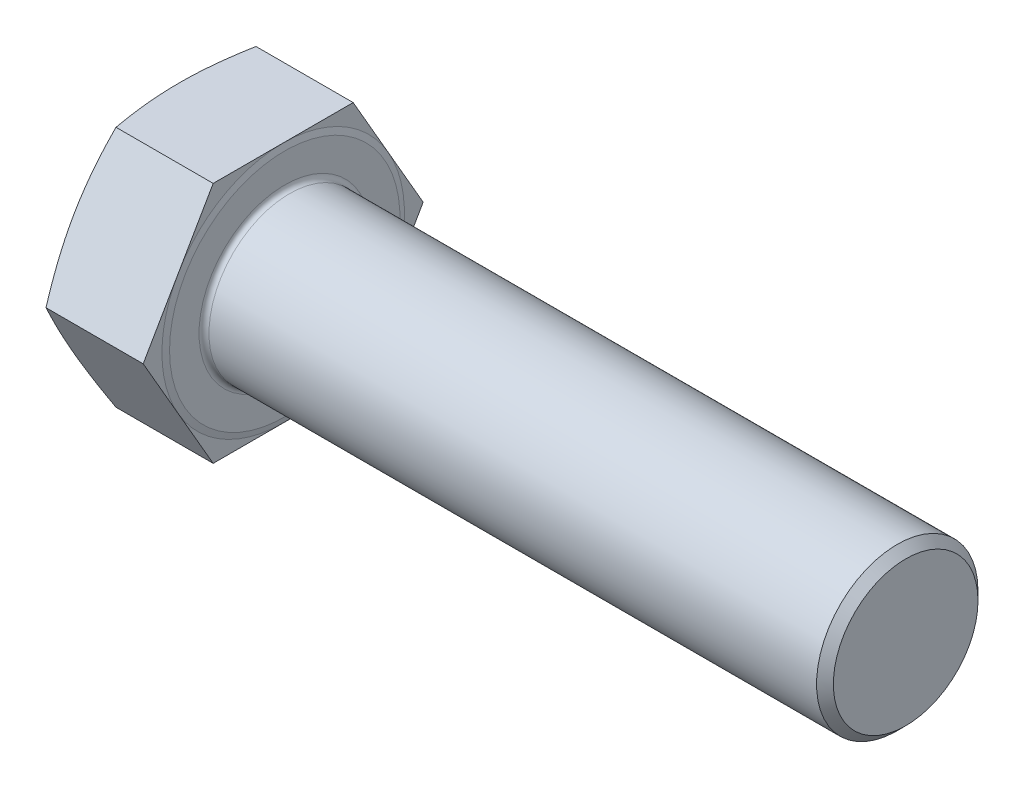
from build123d import *

# Parameters (mm, degrees)
BASEHEAD_DEPTH = 33.5
SKETCH3_R      = 26
BASEBODY_DEPTH = 200
HEADFILLET_R   = 1.6
CHAMFER1_SIZE  = 2.7065


with BuildPart() as part:
    # Sketch-BaseHead → BaseHead (new body)
    with BuildSketch(Plane(origin=(0, 0, 0), x_dir=(0, 0, -1), z_dir=(1, 0, 0))):
        Polygon((45.091056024, 0), (22.545528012, 39.05), (-22.545528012, 39.05), (-45.091056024, 0), (-22.545528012, -39.05), (22.545528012, -39.05), align=None)
    extrude(amount=BASEHEAD_DEPTH)

    # Sketch4 → HeadChamfer (revolve, cut)
    with BuildSketch(Plane(origin=(-0.264637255, 0, 5.916896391), x_dir=(0, 0, -1), z_dir=(0, 1, 0))):
        Polygon((51.007952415, -0.264637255), (44.966896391, -0.264637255), (51.007952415, -2.463401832), align=None)
    revolve(axis=Axis((-4.001564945, 0, 0), (1, 0, 0)), mode=Mode.SUBTRACT)

    # Sketch1 → Revolve1 (revolve)
    with BuildSketch(Plane.XY, mode=Mode.PRIVATE) as revolve1_sk:
        Polygon((33.5, 0), (34, 0), (34, -37.1), (33.5, -39.05), align=None)
    revolve(revolve1_sk.sketch.rotate(Axis((-4.001564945, 0, 0), (1, 0, 0)), 270), axis=Axis((-4.001564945, 0, 0), (1, 0, 0)))

    # Sketch3 → BaseBody (add)
    with BuildSketch(Plane(origin=(34, 0, 0), x_dir=(0, 0, -1), z_dir=(1, 0, 0))):
        Circle(SKETCH3_R)
    extrude(amount=BASEBODY_DEPTH)

    # HeadFillet
    headfillet_edges = [part.edges().sort_by_distance(p)[0] for p in [
        (34, 0, 26),
    ]]
    fillet(headfillet_edges, radius=HEADFILLET_R)

    # Chamfer1
    chamfer1_edges = [part.edges().sort_by_distance(p)[0] for p in [
        (234, 0, 26),
    ]]
    chamfer(chamfer1_edges, length=CHAMFER1_SIZE)


solid = part.part
